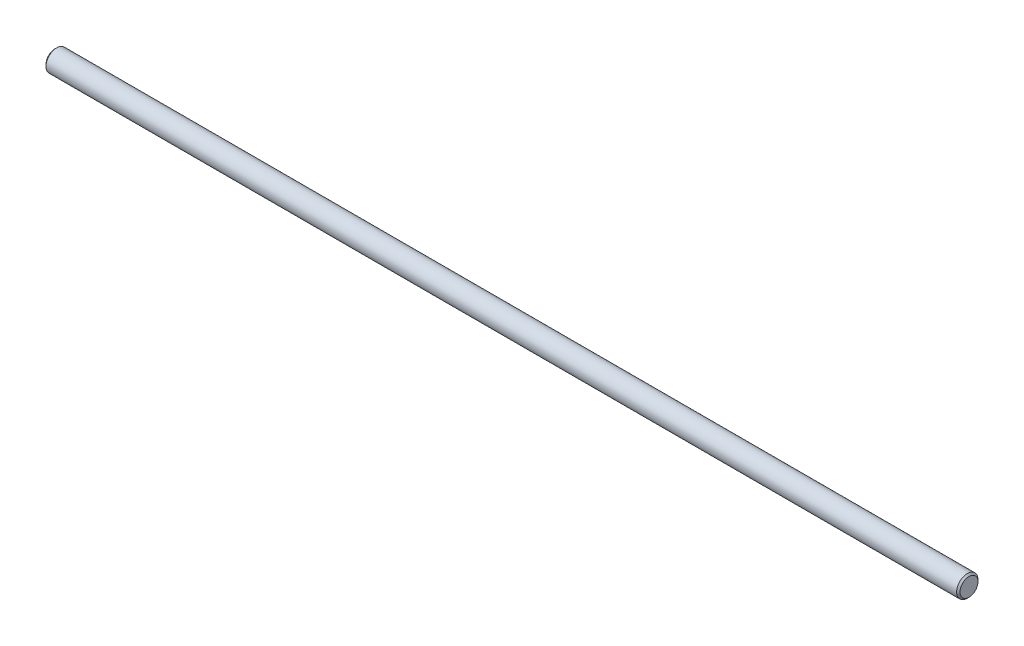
from build123d import *

# Parameters (mm, degrees)
SKETCH1_R      = 2.38125
EXTRUDE1_DEPTH = 203.2
CHAMFER1_SIZE  = 0.381


with BuildPart() as part:
    # Sketch1 → Extrude1 (new body)
    with BuildSketch(Plane(origin=(0, 0, 0), x_dir=(0, 0, -1), z_dir=(1, 0, 0))):
        Circle(SKETCH1_R)
    extrude(amount=EXTRUDE1_DEPTH)

    # Chamfer1
    chamfer1_edges = [part.edges().sort_by_distance(p)[0] for p in [
        (0, 0, 2.38125),
        (203.2, 0, 2.38125),
    ]]
    chamfer(chamfer1_edges, length=CHAMFER1_SIZE)


solid = part.part
